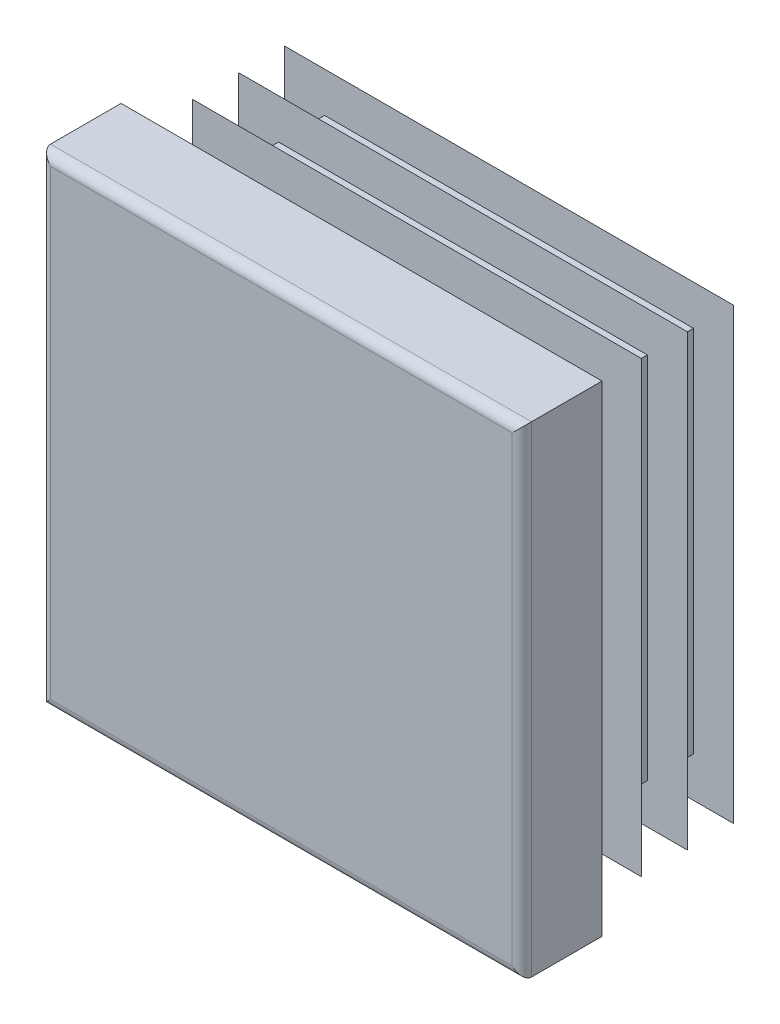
ISO-10303-21;
HEADER;
FILE_DESCRIPTION(('STEP AP214'),'2;1');
FILE_NAME('part.step','',(''),(''),'','','');
FILE_SCHEMA(('AUTOMOTIVE_DESIGN { 1 0 10303 214 1 1 1 1 }'));
ENDSEC;
DATA;
#1=APPLICATION_CONTEXT('core data for automotive mechanical design processes');
#2=APPLICATION_PROTOCOL_DEFINITION('international standard','automotive_design',2000,#1);
#3=PRODUCT_CONTEXT('',#1,'mechanical');
#4=PRODUCT('Part','Part','',(#3));
#5=PRODUCT_RELATED_PRODUCT_CATEGORY('part','',(#4));
#6=PRODUCT_DEFINITION_FORMATION('','',#4);
#7=PRODUCT_DEFINITION_CONTEXT('part definition',#1,'design');
#8=PRODUCT_DEFINITION('design','',#6,#7);
#9=PRODUCT_DEFINITION_SHAPE('','',#8);
#10=(LENGTH_UNIT() NAMED_UNIT(*) SI_UNIT(.MILLI.,.METRE.));
#11=(NAMED_UNIT(*) PLANE_ANGLE_UNIT() SI_UNIT($,.RADIAN.));
#12=(NAMED_UNIT(*) SI_UNIT($,.STERADIAN.) SOLID_ANGLE_UNIT());
#13=UNCERTAINTY_MEASURE_WITH_UNIT(LENGTH_MEASURE(1.E-05),#10,'distance_accuracy_value','');
#14=(GEOMETRIC_REPRESENTATION_CONTEXT(3) GLOBAL_UNCERTAINTY_ASSIGNED_CONTEXT((#13)) GLOBAL_UNIT_ASSIGNED_CONTEXT((#10,
#11,#12)) REPRESENTATION_CONTEXT('',''));
#15=CARTESIAN_POINT('',(0.,0.,0.));
#16=DIRECTION('',(0.,0.,1.));
#17=DIRECTION('',(1.,0.,0.));
#18=AXIS2_PLACEMENT_3D('',#15,#16,#17);
#19=CARTESIAN_POINT('',(14.4,-15.,5.));
#20=DIRECTION('',(0.,0.,-1.));
#21=DIRECTION('',(0.,1.,0.));
#22=AXIS2_PLACEMENT_3D('',#19,#20,#21);
#23=PLANE('',#22);
#24=DIRECTION('',(0.,1.,0.));
#25=VECTOR('',#24,1.);
#26=CARTESIAN_POINT('',(-14.4,-15.,5.));
#27=LINE('',#26,#25);
#28=CARTESIAN_POINT('',(-14.4,-14.4,5.));
#29=VERTEX_POINT('',#28);
#30=CARTESIAN_POINT('',(-14.4,14.4,5.));
#31=VERTEX_POINT('',#30);
#32=EDGE_CURVE('E262',#29,#31,#27,.T.);
#33=ORIENTED_EDGE('',*,*,#32,.F.);
#34=DIRECTION('',(-1.,0.,0.));
#35=VECTOR('',#34,1.);
#36=CARTESIAN_POINT('',(15.,-14.4,5.));
#37=LINE('',#36,#35);
#38=CARTESIAN_POINT('',(14.4,-14.4,5.));
#39=VERTEX_POINT('',#38);
#40=EDGE_CURVE('E432',#39,#29,#37,.T.);
#41=ORIENTED_EDGE('',*,*,#40,.F.);
#42=DIRECTION('',(0.,1.,0.));
#43=VECTOR('',#42,1.);
#44=CARTESIAN_POINT('',(14.4,-15.,5.));
#45=LINE('',#44,#43);
#46=CARTESIAN_POINT('',(14.4,14.4,5.));
#47=VERTEX_POINT('',#46);
#48=EDGE_CURVE('E257',#39,#47,#45,.T.);
#49=ORIENTED_EDGE('',*,*,#48,.T.);
#50=DIRECTION('',(-1.,0.,0.));
#51=VECTOR('',#50,1.);
#52=CARTESIAN_POINT('',(15.,14.4,5.));
#53=LINE('',#52,#51);
#54=EDGE_CURVE('E534',#47,#31,#53,.T.);
#55=ORIENTED_EDGE('',*,*,#54,.T.);
#56=EDGE_LOOP('',(#33,#41,#49,#55));
#57=FACE_BOUND('',#56,.T.);
#58=ADVANCED_FACE('F14',(#57),#23,.F.);
#59=CARTESIAN_POINT('',(-14.4,-15.,4.4));
#60=DIRECTION('',(0.,1.,0.));
#61=DIRECTION('',(-1.,0.,0.));
#62=AXIS2_PLACEMENT_3D('',#59,#60,#61);
#63=CYLINDRICAL_SURFACE('',#62,0.6);
#64=DIRECTION('',(0.,1.,0.));
#65=VECTOR('',#64,1.);
#66=CARTESIAN_POINT('',(-15.,-15.,4.4));
#67=LINE('',#66,#65);
#68=CARTESIAN_POINT('',(-15.,-15.,4.4));
#69=VERTEX_POINT('',#68);
#70=CARTESIAN_POINT('',(-15.,15.,4.4));
#71=VERTEX_POINT('',#70);
#72=EDGE_CURVE('E354',#69,#71,#67,.T.);
#73=ORIENTED_EDGE('',*,*,#72,.F.);
#74=CARTESIAN_POINT('',(-14.4,-14.4,4.4));
#75=DIRECTION('',(-0.707106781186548,0.707106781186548,0.));
#76=DIRECTION('',(0.707106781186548,0.707106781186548,0.));
#77=AXIS2_PLACEMENT_3D('',#74,#75,#76);
#78=ELLIPSE('',#77,0.848528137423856,0.6);
#79=EDGE_CURVE('E59',#69,#29,#78,.T.);
#80=ORIENTED_EDGE('',*,*,#79,.T.);
#81=ORIENTED_EDGE('',*,*,#32,.T.);
#82=CARTESIAN_POINT('',(-14.4,14.4,4.4));
#83=DIRECTION('',(0.707106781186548,0.707106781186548,0.));
#84=DIRECTION('',(-0.707106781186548,0.707106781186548,0.));
#85=AXIS2_PLACEMENT_3D('',#82,#83,#84);
#86=ELLIPSE('',#85,0.848528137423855,0.6);
#87=EDGE_CURVE('E258',#31,#71,#86,.F.);
#88=ORIENTED_EDGE('',*,*,#87,.T.);
#89=EDGE_LOOP('',(#73,#80,#81,#88));
#90=FACE_BOUND('',#89,.T.);
#91=ADVANCED_FACE('F16',(#90),#63,.T.);
#92=CARTESIAN_POINT('',(-15.,-15.,4.4));
#93=DIRECTION('',(1.,0.,0.));
#94=DIRECTION('',(0.,1.,0.));
#95=AXIS2_PLACEMENT_3D('',#92,#93,#94);
#96=PLANE('',#95);
#97=DIRECTION('',(0.,0.,-1.));
#98=VECTOR('',#97,1.);
#99=CARTESIAN_POINT('',(-15.,15.,4.4));
#100=LINE('',#99,#98);
#101=CARTESIAN_POINT('',(-15.,15.,0.));
#102=VERTEX_POINT('',#101);
#103=EDGE_CURVE('E519',#71,#102,#100,.T.);
#104=ORIENTED_EDGE('',*,*,#103,.T.);
#105=DIRECTION('',(0.,1.,0.));
#106=VECTOR('',#105,1.);
#107=CARTESIAN_POINT('',(-15.,-15.,0.));
#108=LINE('',#107,#106);
#109=CARTESIAN_POINT('',(-15.,-15.,0.));
#110=VERTEX_POINT('',#109);
#111=EDGE_CURVE('E352',#110,#102,#108,.T.);
#112=ORIENTED_EDGE('',*,*,#111,.F.);
#113=DIRECTION('',(0.,0.,-1.));
#114=VECTOR('',#113,1.);
#115=CARTESIAN_POINT('',(-15.,-15.,4.4));
#116=LINE('',#115,#114);
#117=EDGE_CURVE('E520',#69,#110,#116,.T.);
#118=ORIENTED_EDGE('',*,*,#117,.F.);
#119=ORIENTED_EDGE('',*,*,#72,.T.);
#120=EDGE_LOOP('',(#104,#112,#118,#119));
#121=FACE_BOUND('',#120,.T.);
#122=ADVANCED_FACE('F604',(#121),#96,.F.);
#123=CARTESIAN_POINT('',(-11.5,-15.,0.));
#124=DIRECTION('',(1.,0.,0.));
#125=DIRECTION('',(0.,1.,0.));
#126=AXIS2_PLACEMENT_3D('',#123,#124,#125);
#127=PLANE('',#126);
#128=DIRECTION('',(0.,1.,0.));
#129=VECTOR('',#128,1.);
#130=CARTESIAN_POINT('',(-11.5,-15.,0.));
#131=LINE('',#130,#129);
#132=CARTESIAN_POINT('',(-11.5,-11.5,0.));
#133=VERTEX_POINT('',#132);
#134=CARTESIAN_POINT('',(-11.5,11.5,0.));
#135=VERTEX_POINT('',#134);
#136=EDGE_CURVE('E349',#133,#135,#131,.T.);
#137=ORIENTED_EDGE('',*,*,#136,.T.);
#138=DIRECTION('',(0.,0.,-1.));
#139=VECTOR('',#138,1.);
#140=CARTESIAN_POINT('',(-11.5,11.5,0.));
#141=LINE('',#140,#139);
#142=CARTESIAN_POINT('',(-11.5,11.5,-0.575));
#143=VERTEX_POINT('',#142);
#144=EDGE_CURVE('E445',#135,#143,#141,.T.);
#145=ORIENTED_EDGE('',*,*,#144,.T.);
#146=DIRECTION('',(0.,1.,0.));
#147=VECTOR('',#146,1.);
#148=CARTESIAN_POINT('',(-11.5,-15.,-0.575));
#149=LINE('',#148,#147);
#150=CARTESIAN_POINT('',(-11.5,-11.5,-0.575));
#151=VERTEX_POINT('',#150);
#152=EDGE_CURVE('E346',#151,#143,#149,.T.);
#153=ORIENTED_EDGE('',*,*,#152,.F.);
#154=DIRECTION('',(0.,0.,1.));
#155=VECTOR('',#154,1.);
#156=CARTESIAN_POINT('',(-11.5,-11.5,0.));
#157=LINE('',#156,#155);
#158=EDGE_CURVE('E439',#151,#133,#157,.T.);
#159=ORIENTED_EDGE('',*,*,#158,.T.);
#160=EDGE_LOOP('',(#137,#145,#153,#159));
#161=FACE_BOUND('',#160,.T.);
#162=ADVANCED_FACE('F728',(#161),#127,.F.);
#163=CARTESIAN_POINT('',(-14.,-15.,-0.575));
#164=DIRECTION('',(0.573576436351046,0.,0.819152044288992));
#165=DIRECTION('',(-0.819152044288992,0.,0.573576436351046));
#166=AXIS2_PLACEMENT_3D('',#163,#164,#165);
#167=PLANE('',#166);
#168=DIRECTION('',(0.,1.,0.));
#169=VECTOR('',#168,1.);
#170=CARTESIAN_POINT('',(-14.,-15.,-0.575));
#171=LINE('',#170,#169);
#172=CARTESIAN_POINT('',(-14.,-14.,-0.575));
#173=VERTEX_POINT('',#172);
#174=CARTESIAN_POINT('',(-14.,14.,-0.575));
#175=VERTEX_POINT('',#174);
#176=EDGE_CURVE('E344',#173,#175,#171,.T.);
#177=ORIENTED_EDGE('',*,*,#176,.T.);
#178=DIRECTION('',(0.633687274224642,-0.633687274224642,-0.443712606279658));
#179=VECTOR('',#178,1.);
#180=CARTESIAN_POINT('',(-2.35477271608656,2.35477271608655,-8.72907592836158));
#181=LINE('',#180,#179);
#182=CARTESIAN_POINT('',(-11.5,11.5,-2.32551884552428));
#183=VERTEX_POINT('',#182);
#184=EDGE_CURVE('E457',#175,#183,#181,.T.);
#185=ORIENTED_EDGE('',*,*,#184,.T.);
#186=DIRECTION('',(0.,1.,0.));
#187=VECTOR('',#186,1.);
#188=CARTESIAN_POINT('',(-11.5,-15.,-2.32551884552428));
#189=LINE('',#188,#187);
#190=CARTESIAN_POINT('',(-11.5,-11.5,-2.32551884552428));
#191=VERTEX_POINT('',#190);
#192=EDGE_CURVE('E341',#191,#183,#189,.T.);
#193=ORIENTED_EDGE('',*,*,#192,.F.);
#194=DIRECTION('',(-0.633687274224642,-0.633687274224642,0.443712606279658));
#195=VECTOR('',#194,1.);
#196=CARTESIAN_POINT('',(-14.4015595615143,-14.4015595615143,-0.293824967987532));
#197=LINE('',#196,#195);
#198=EDGE_CURVE('E451',#191,#173,#197,.T.);
#199=ORIENTED_EDGE('',*,*,#198,.T.);
#200=EDGE_LOOP('',(#177,#185,#193,#199));
#201=FACE_BOUND('',#200,.T.);
#202=ADVANCED_FACE('F732',(#201),#167,.F.);
#203=CARTESIAN_POINT('',(-11.5,-15.,-2.32551884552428));
#204=DIRECTION('',(1.,0.,0.));
#205=DIRECTION('',(0.,1.,0.));
#206=AXIS2_PLACEMENT_3D('',#203,#204,#205);
#207=PLANE('',#206);
#208=ORIENTED_EDGE('',*,*,#192,.T.);
#209=DIRECTION('',(0.,0.,-1.));
#210=VECTOR('',#209,1.);
#211=CARTESIAN_POINT('',(-11.5,11.5,-2.32551884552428));
#212=LINE('',#211,#210);
#213=CARTESIAN_POINT('',(-11.5,11.5,-3.45));
#214=VERTEX_POINT('',#213);
#215=EDGE_CURVE('E463',#183,#214,#212,.T.);
#216=ORIENTED_EDGE('',*,*,#215,.T.);
#217=DIRECTION('',(0.,1.,0.));
#218=VECTOR('',#217,1.);
#219=CARTESIAN_POINT('',(-11.5,-15.,-3.45));
#220=LINE('',#219,#218);
#221=CARTESIAN_POINT('',(-11.5,-11.5,-3.45));
#222=VERTEX_POINT('',#221);
#223=EDGE_CURVE('E338',#222,#214,#220,.T.);
#224=ORIENTED_EDGE('',*,*,#223,.F.);
#225=DIRECTION('',(0.,0.,1.));
#226=VECTOR('',#225,1.);
#227=CARTESIAN_POINT('',(-11.5,-11.5,-2.32551884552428));
#228=LINE('',#227,#226);
#229=EDGE_CURVE('E460',#222,#191,#228,.T.);
#230=ORIENTED_EDGE('',*,*,#229,.T.);
#231=EDGE_LOOP('',(#208,#216,#224,#230));
#232=FACE_BOUND('',#231,.T.);
#233=ADVANCED_FACE('F738',(#232),#207,.F.);
#234=CARTESIAN_POINT('',(-14.,-15.,-3.45));
#235=DIRECTION('',(0.573576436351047,0.,0.819152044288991));
#236=DIRECTION('',(-0.819152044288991,0.,0.573576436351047));
#237=AXIS2_PLACEMENT_3D('',#234,#235,#236);
#238=PLANE('',#237);
#239=DIRECTION('',(0.,1.,0.));
#240=VECTOR('',#239,1.);
#241=CARTESIAN_POINT('',(-14.,-15.,-3.45));
#242=LINE('',#241,#240);
#243=CARTESIAN_POINT('',(-14.,-14.,-3.45));
#244=VERTEX_POINT('',#243);
#245=CARTESIAN_POINT('',(-14.,14.,-3.45));
#246=VERTEX_POINT('',#245);
#247=EDGE_CURVE('E336',#244,#246,#242,.T.);
#248=ORIENTED_EDGE('',*,*,#247,.T.);
#249=DIRECTION('',(0.633687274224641,-0.633687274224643,-0.443712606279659));
#250=VECTOR('',#249,1.);
#251=CARTESIAN_POINT('',(-2.35477271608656,2.35477271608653,-11.6040759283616));
#252=LINE('',#251,#250);
#253=CARTESIAN_POINT('',(-11.5,11.5,-5.20051884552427));
#254=VERTEX_POINT('',#253);
#255=EDGE_CURVE('E475',#246,#254,#252,.T.);
#256=ORIENTED_EDGE('',*,*,#255,.T.);
#257=DIRECTION('',(0.,1.,0.));
#258=VECTOR('',#257,1.);
#259=CARTESIAN_POINT('',(-11.5,-15.,-5.20051884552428));
#260=LINE('',#259,#258);
#261=CARTESIAN_POINT('',(-11.5,-11.5,-5.20051884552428));
#262=VERTEX_POINT('',#261);
#263=EDGE_CURVE('E333',#262,#254,#260,.T.);
#264=ORIENTED_EDGE('',*,*,#263,.F.);
#265=DIRECTION('',(-0.633687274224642,-0.633687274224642,0.443712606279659));
#266=VECTOR('',#265,1.);
#267=CARTESIAN_POINT('',(-14.4015595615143,-14.4015595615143,-3.16882496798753));
#268=LINE('',#267,#266);
#269=EDGE_CURVE('E469',#262,#244,#268,.T.);
#270=ORIENTED_EDGE('',*,*,#269,.T.);
#271=EDGE_LOOP('',(#248,#256,#264,#270));
#272=FACE_BOUND('',#271,.T.);
#273=ADVANCED_FACE('F742',(#272),#238,.F.);
#274=CARTESIAN_POINT('',(-11.5,-15.,-5.20051884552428));
#275=DIRECTION('',(1.,0.,0.));
#276=DIRECTION('',(0.,1.,0.));
#277=AXIS2_PLACEMENT_3D('',#274,#275,#276);
#278=PLANE('',#277);
#279=ORIENTED_EDGE('',*,*,#263,.T.);
#280=DIRECTION('',(0.,0.,-1.));
#281=VECTOR('',#280,1.);
#282=CARTESIAN_POINT('',(-11.5,11.5,-5.20051884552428));
#283=LINE('',#282,#281);
#284=CARTESIAN_POINT('',(-11.5,11.5,-6.325));
#285=VERTEX_POINT('',#284);
#286=EDGE_CURVE('E481',#254,#285,#283,.T.);
#287=ORIENTED_EDGE('',*,*,#286,.T.);
#288=DIRECTION('',(0.,1.,0.));
#289=VECTOR('',#288,1.);
#290=CARTESIAN_POINT('',(-11.5,-15.,-6.325));
#291=LINE('',#290,#289);
#292=CARTESIAN_POINT('',(-11.5,-11.5,-6.325));
#293=VERTEX_POINT('',#292);
#294=EDGE_CURVE('E330',#293,#285,#291,.T.);
#295=ORIENTED_EDGE('',*,*,#294,.F.);
#296=DIRECTION('',(0.,0.,1.));
#297=VECTOR('',#296,1.);
#298=CARTESIAN_POINT('',(-11.5,-11.5,-5.20051884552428));
#299=LINE('',#298,#297);
#300=EDGE_CURVE('E478',#293,#262,#299,.T.);
#301=ORIENTED_EDGE('',*,*,#300,.T.);
#302=EDGE_LOOP('',(#279,#287,#295,#301));
#303=FACE_BOUND('',#302,.T.);
#304=ADVANCED_FACE('F746',(#303),#278,.F.);
#305=CARTESIAN_POINT('',(-14.,-15.,-6.325));
#306=DIRECTION('',(0.573576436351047,0.,0.819152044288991));
#307=DIRECTION('',(-0.819152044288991,0.,0.573576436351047));
#308=AXIS2_PLACEMENT_3D('',#305,#306,#307);
#309=PLANE('',#308);
#310=DIRECTION('',(0.,1.,0.));
#311=VECTOR('',#310,1.);
#312=CARTESIAN_POINT('',(-14.,-15.,-6.325));
#313=LINE('',#312,#311);
#314=CARTESIAN_POINT('',(-14.,-14.,-6.325));
#315=VERTEX_POINT('',#314);
#316=CARTESIAN_POINT('',(-14.,14.,-6.325));
#317=VERTEX_POINT('',#316);
#318=EDGE_CURVE('E328',#315,#317,#313,.T.);
#319=ORIENTED_EDGE('',*,*,#318,.T.);
#320=DIRECTION('',(0.633687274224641,-0.633687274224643,-0.443712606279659));
#321=VECTOR('',#320,1.);
#322=CARTESIAN_POINT('',(-2.35477271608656,2.35477271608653,-14.4790759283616));
#323=LINE('',#322,#321);
#324=CARTESIAN_POINT('',(-11.5,11.5,-8.07551884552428));
#325=VERTEX_POINT('',#324);
#326=EDGE_CURVE('E493',#317,#325,#323,.T.);
#327=ORIENTED_EDGE('',*,*,#326,.T.);
#328=DIRECTION('',(0.,1.,0.));
#329=VECTOR('',#328,1.);
#330=CARTESIAN_POINT('',(-11.5,-15.,-8.07551884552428));
#331=LINE('',#330,#329);
#332=CARTESIAN_POINT('',(-11.5,-11.5,-8.07551884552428));
#333=VERTEX_POINT('',#332);
#334=EDGE_CURVE('E325',#333,#325,#331,.T.);
#335=ORIENTED_EDGE('',*,*,#334,.F.);
#336=DIRECTION('',(-0.633687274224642,-0.633687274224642,0.443712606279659));
#337=VECTOR('',#336,1.);
#338=CARTESIAN_POINT('',(-14.4015595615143,-14.4015595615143,-6.04382496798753));
#339=LINE('',#338,#337);
#340=EDGE_CURVE('E487',#333,#315,#339,.T.);
#341=ORIENTED_EDGE('',*,*,#340,.T.);
#342=EDGE_LOOP('',(#319,#327,#335,#341));
#343=FACE_BOUND('',#342,.T.);
#344=ADVANCED_FACE('F668',(#343),#309,.F.);
#345=CARTESIAN_POINT('',(-11.5,-15.,-8.07551884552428));
#346=DIRECTION('',(1.,0.,0.));
#347=DIRECTION('',(0.,1.,0.));
#348=AXIS2_PLACEMENT_3D('',#345,#346,#347);
#349=PLANE('',#348);
#350=ORIENTED_EDGE('',*,*,#334,.T.);
#351=DIRECTION('',(0.,0.,-1.));
#352=VECTOR('',#351,1.);
#353=CARTESIAN_POINT('',(-11.5,11.5,-8.07551884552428));
#354=LINE('',#353,#352);
#355=CARTESIAN_POINT('',(-11.5,11.5,-9.2));
#356=VERTEX_POINT('',#355);
#357=EDGE_CURVE('E499',#325,#356,#354,.T.);
#358=ORIENTED_EDGE('',*,*,#357,.T.);
#359=DIRECTION('',(0.,1.,0.));
#360=VECTOR('',#359,1.);
#361=CARTESIAN_POINT('',(-11.5,-15.,-9.2));
#362=LINE('',#361,#360);
#363=CARTESIAN_POINT('',(-11.5,-11.5,-9.2));
#364=VERTEX_POINT('',#363);
#365=EDGE_CURVE('E322',#364,#356,#362,.T.);
#366=ORIENTED_EDGE('',*,*,#365,.F.);
#367=DIRECTION('',(0.,0.,1.));
#368=VECTOR('',#367,1.);
#369=CARTESIAN_POINT('',(-11.5,-11.5,-8.07551884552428));
#370=LINE('',#369,#368);
#371=EDGE_CURVE('E496',#364,#333,#370,.T.);
#372=ORIENTED_EDGE('',*,*,#371,.T.);
#373=EDGE_LOOP('',(#350,#358,#366,#372));
#374=FACE_BOUND('',#373,.T.);
#375=ADVANCED_FACE('F665',(#374),#349,.F.);
#376=CARTESIAN_POINT('',(-14.,-15.,-9.2));
#377=DIRECTION('',(0.573576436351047,0.,0.819152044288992));
#378=DIRECTION('',(-0.819152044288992,0.,0.573576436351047));
#379=AXIS2_PLACEMENT_3D('',#376,#377,#378);
#380=PLANE('',#379);
#381=DIRECTION('',(0.,1.,0.));
#382=VECTOR('',#381,1.);
#383=CARTESIAN_POINT('',(-14.,-15.,-9.2));
#384=LINE('',#383,#382);
#385=CARTESIAN_POINT('',(-14.,-14.,-9.2));
#386=VERTEX_POINT('',#385);
#387=CARTESIAN_POINT('',(-14.,14.,-9.2));
#388=VERTEX_POINT('',#387);
#389=EDGE_CURVE('E320',#386,#388,#384,.T.);
#390=ORIENTED_EDGE('',*,*,#389,.T.);
#391=DIRECTION('',(0.633687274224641,-0.633687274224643,-0.443712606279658));
#392=VECTOR('',#391,1.);
#393=CARTESIAN_POINT('',(-2.35477271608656,2.35477271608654,-17.3540759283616));
#394=LINE('',#393,#392);
#395=CARTESIAN_POINT('',(-11.5,11.5,-10.9505188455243));
#396=VERTEX_POINT('',#395);
#397=EDGE_CURVE('E511',#388,#396,#394,.T.);
#398=ORIENTED_EDGE('',*,*,#397,.T.);
#399=DIRECTION('',(0.,1.,0.));
#400=VECTOR('',#399,1.);
#401=CARTESIAN_POINT('',(-11.5,-15.,-10.9505188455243));
#402=LINE('',#401,#400);
#403=CARTESIAN_POINT('',(-11.5,-11.5,-10.9505188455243));
#404=VERTEX_POINT('',#403);
#405=EDGE_CURVE('E317',#404,#396,#402,.T.);
#406=ORIENTED_EDGE('',*,*,#405,.F.);
#407=DIRECTION('',(-0.633687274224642,-0.633687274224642,0.443712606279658));
#408=VECTOR('',#407,1.);
#409=CARTESIAN_POINT('',(-14.4015595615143,-14.4015595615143,-8.91882496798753));
#410=LINE('',#409,#408);
#411=EDGE_CURVE('E505',#404,#386,#410,.T.);
#412=ORIENTED_EDGE('',*,*,#411,.T.);
#413=EDGE_LOOP('',(#390,#398,#406,#412));
#414=FACE_BOUND('',#413,.T.);
#415=ADVANCED_FACE('F580',(#414),#380,.F.);
#416=CARTESIAN_POINT('',(-11.5,-15.,-10.9505188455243));
#417=DIRECTION('',(1.,0.,0.));
#418=DIRECTION('',(0.,1.,0.));
#419=AXIS2_PLACEMENT_3D('',#416,#417,#418);
#420=PLANE('',#419);
#421=ORIENTED_EDGE('',*,*,#405,.T.);
#422=DIRECTION('',(0.,0.,-1.));
#423=VECTOR('',#422,1.);
#424=CARTESIAN_POINT('',(-11.5,11.5,-10.9505188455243));
#425=LINE('',#424,#423);
#426=CARTESIAN_POINT('',(-11.5,11.5,-11.5));
#427=VERTEX_POINT('',#426);
#428=EDGE_CURVE('E517',#396,#427,#425,.T.);
#429=ORIENTED_EDGE('',*,*,#428,.T.);
#430=DIRECTION('',(0.,1.,0.));
#431=VECTOR('',#430,1.);
#432=CARTESIAN_POINT('',(-11.5,-15.,-11.5));
#433=LINE('',#432,#431);
#434=CARTESIAN_POINT('',(-11.5,-11.5,-11.5));
#435=VERTEX_POINT('',#434);
#436=EDGE_CURVE('E314',#435,#427,#433,.T.);
#437=ORIENTED_EDGE('',*,*,#436,.F.);
#438=DIRECTION('',(0.,0.,1.));
#439=VECTOR('',#438,1.);
#440=CARTESIAN_POINT('',(-11.5,-11.5,-10.9505188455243));
#441=LINE('',#440,#439);
#442=EDGE_CURVE('E514',#435,#404,#441,.T.);
#443=ORIENTED_EDGE('',*,*,#442,.T.);
#444=EDGE_LOOP('',(#421,#429,#437,#443));
#445=FACE_BOUND('',#444,.T.);
#446=ADVANCED_FACE('F582',(#445),#420,.F.);
#447=CARTESIAN_POINT('',(-11.5,-15.,-11.5));
#448=DIRECTION('',(0.,0.,1.));
#449=DIRECTION('',(0.,-1.,0.));
#450=AXIS2_PLACEMENT_3D('',#447,#448,#449);
#451=PLANE('',#450);
#452=ORIENTED_EDGE('',*,*,#436,.T.);
#453=DIRECTION('',(-1.,0.,0.));
#454=VECTOR('',#453,1.);
#455=CARTESIAN_POINT('',(15.,11.5,-11.5));
#456=LINE('',#455,#454);
#457=CARTESIAN_POINT('',(11.5,11.5,-11.5));
#458=VERTEX_POINT('',#457);
#459=EDGE_CURVE('E388',#458,#427,#456,.T.);
#460=ORIENTED_EDGE('',*,*,#459,.F.);
#461=DIRECTION('',(0.,1.,0.));
#462=VECTOR('',#461,1.);
#463=CARTESIAN_POINT('',(11.5,-15.,-11.5));
#464=LINE('',#463,#462);
#465=CARTESIAN_POINT('',(11.5,-11.5,-11.5));
#466=VERTEX_POINT('',#465);
#467=EDGE_CURVE('E311',#466,#458,#464,.T.);
#468=ORIENTED_EDGE('',*,*,#467,.F.);
#469=DIRECTION('',(-1.,0.,0.));
#470=VECTOR('',#469,1.);
#471=CARTESIAN_POINT('',(15.,-11.5,-11.5));
#472=LINE('',#471,#470);
#473=EDGE_CURVE('E386',#466,#435,#472,.T.);
#474=ORIENTED_EDGE('',*,*,#473,.T.);
#475=EDGE_LOOP('',(#452,#460,#468,#474));
#476=FACE_BOUND('',#475,.T.);
#477=ADVANCED_FACE('F385',(#476),#451,.F.);
#478=CARTESIAN_POINT('',(11.5,-15.,-11.5));
#479=DIRECTION('',(-1.,0.,0.));
#480=DIRECTION('',(0.,-1.,0.));
#481=AXIS2_PLACEMENT_3D('',#478,#479,#480);
#482=PLANE('',#481);
#483=ORIENTED_EDGE('',*,*,#467,.T.);
#484=DIRECTION('',(0.,0.,1.));
#485=VECTOR('',#484,1.);
#486=CARTESIAN_POINT('',(11.5,11.5,-11.5));
#487=LINE('',#486,#485);
#488=CARTESIAN_POINT('',(11.5,11.5,-10.9505188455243));
#489=VERTEX_POINT('',#488);
#490=EDGE_CURVE('E9',#458,#489,#487,.T.);
#491=ORIENTED_EDGE('',*,*,#490,.T.);
#492=DIRECTION('',(0.,1.,0.));
#493=VECTOR('',#492,1.);
#494=CARTESIAN_POINT('',(11.5,-15.,-10.9505188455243));
#495=LINE('',#494,#493);
#496=CARTESIAN_POINT('',(11.5,-11.5,-10.9505188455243));
#497=VERTEX_POINT('',#496);
#498=EDGE_CURVE('E308',#497,#489,#495,.T.);
#499=ORIENTED_EDGE('',*,*,#498,.F.);
#500=DIRECTION('',(0.,0.,-1.));
#501=VECTOR('',#500,1.);
#502=CARTESIAN_POINT('',(11.5,-11.5,-11.5));
#503=LINE('',#502,#501);
#504=EDGE_CURVE('E23',#497,#466,#503,.T.);
#505=ORIENTED_EDGE('',*,*,#504,.T.);
#506=EDGE_LOOP('',(#483,#491,#499,#505));
#507=FACE_BOUND('',#506,.T.);
#508=ADVANCED_FACE('F378',(#507),#482,.F.);
#509=CARTESIAN_POINT('',(11.5,-15.,-10.9505188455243));
#510=DIRECTION('',(-0.573576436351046,0.,0.819152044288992));
#511=DIRECTION('',(-0.819152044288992,0.,-0.573576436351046));
#512=AXIS2_PLACEMENT_3D('',#509,#510,#511);
#513=PLANE('',#512);
#514=ORIENTED_EDGE('',*,*,#498,.T.);
#515=DIRECTION('',(0.633687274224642,0.633687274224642,0.443712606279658));
#516=VECTOR('',#515,1.);
#517=CARTESIAN_POINT('',(0.858671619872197,0.858671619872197,-18.4016571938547));
#518=LINE('',#517,#516);
#519=CARTESIAN_POINT('',(14.,14.,-9.2));
#520=VERTEX_POINT('',#519);
#521=EDGE_CURVE('E508',#489,#520,#518,.T.);
#522=ORIENTED_EDGE('',*,*,#521,.T.);
#523=DIRECTION('',(0.,1.,0.));
#524=VECTOR('',#523,1.);
#525=CARTESIAN_POINT('',(14.,-15.,-9.2));
#526=LINE('',#525,#524);
#527=CARTESIAN_POINT('',(14.,-14.,-9.2));
#528=VERTEX_POINT('',#527);
#529=EDGE_CURVE('E305',#528,#520,#526,.T.);
#530=ORIENTED_EDGE('',*,*,#529,.F.);
#531=DIRECTION('',(-0.633687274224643,0.633687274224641,-0.443712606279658));
#532=VECTOR('',#531,1.);
#533=CARTESIAN_POINT('',(12.9054584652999,-12.9054584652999,-9.96640623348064));
#534=LINE('',#533,#532);
#535=EDGE_CURVE('E502',#528,#497,#534,.T.);
#536=ORIENTED_EDGE('',*,*,#535,.T.);
#537=EDGE_LOOP('',(#514,#522,#530,#536));
#538=FACE_BOUND('',#537,.T.);
#539=ADVANCED_FACE('F588',(#538),#513,.F.);
#540=CARTESIAN_POINT('',(14.,-15.,-9.2));
#541=DIRECTION('',(0.,0.,-1.));
#542=DIRECTION('',(0.,1.,0.));
#543=AXIS2_PLACEMENT_3D('',#540,#541,#542);
#544=PLANE('',#543);
#545=ORIENTED_EDGE('',*,*,#529,.T.);
#546=DIRECTION('',(-1.,0.,0.));
#547=VECTOR('',#546,1.);
#548=CARTESIAN_POINT('',(15.,14.,-9.2));
#549=LINE('',#548,#547);
#550=EDGE_CURVE('E394',#520,#388,#549,.T.);
#551=ORIENTED_EDGE('',*,*,#550,.T.);
#552=ORIENTED_EDGE('',*,*,#389,.F.);
#553=DIRECTION('',(-1.,0.,0.));
#554=VECTOR('',#553,1.);
#555=CARTESIAN_POINT('',(15.,-14.,-9.2));
#556=LINE('',#555,#554);
#557=EDGE_CURVE('E401',#528,#386,#556,.T.);
#558=ORIENTED_EDGE('',*,*,#557,.F.);
#559=EDGE_LOOP('',(#545,#551,#552,#558));
#560=FACE_BOUND('',#559,.T.);
#561=ORIENTED_EDGE('',*,*,#365,.T.);
#562=DIRECTION('',(-1.,0.,0.));
#563=VECTOR('',#562,1.);
#564=CARTESIAN_POINT('',(15.,11.5,-9.2));
#565=LINE('',#564,#563);
#566=CARTESIAN_POINT('',(11.5,11.5,-9.2));
#567=VERTEX_POINT('',#566);
#568=EDGE_CURVE('E567',#567,#356,#565,.T.);
#569=ORIENTED_EDGE('',*,*,#568,.F.);
#570=DIRECTION('',(0.,1.,0.));
#571=VECTOR('',#570,1.);
#572=CARTESIAN_POINT('',(11.5,-15.,-9.2));
#573=LINE('',#572,#571);
#574=CARTESIAN_POINT('',(11.5,-11.5,-9.2));
#575=VERTEX_POINT('',#574);
#576=EDGE_CURVE('E302',#575,#567,#573,.T.);
#577=ORIENTED_EDGE('',*,*,#576,.F.);
#578=DIRECTION('',(-1.,0.,0.));
#579=VECTOR('',#578,1.);
#580=CARTESIAN_POINT('',(15.,-11.5,-9.2));
#581=LINE('',#580,#579);
#582=EDGE_CURVE('E403',#575,#364,#581,.T.);
#583=ORIENTED_EDGE('',*,*,#582,.T.);
#584=EDGE_LOOP('',(#561,#569,#577,#583));
#585=FACE_BOUND('',#584,.T.);
#586=ADVANCED_FACE('F571',(#560,#585),#544,.F.);
#587=CARTESIAN_POINT('',(11.5,-15.,-9.2));
#588=DIRECTION('',(-1.,0.,0.));
#589=DIRECTION('',(0.,-1.,0.));
#590=AXIS2_PLACEMENT_3D('',#587,#588,#589);
#591=PLANE('',#590);
#592=ORIENTED_EDGE('',*,*,#576,.T.);
#593=DIRECTION('',(0.,0.,1.));
#594=VECTOR('',#593,1.);
#595=CARTESIAN_POINT('',(11.5,11.5,-9.2));
#596=LINE('',#595,#594);
#597=CARTESIAN_POINT('',(11.5,11.5,-8.07551884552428));
#598=VERTEX_POINT('',#597);
#599=EDGE_CURVE('E372',#567,#598,#596,.T.);
#600=ORIENTED_EDGE('',*,*,#599,.T.);
#601=DIRECTION('',(0.,1.,0.));
#602=VECTOR('',#601,1.);
#603=CARTESIAN_POINT('',(11.5,-15.,-8.07551884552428));
#604=LINE('',#603,#602);
#605=CARTESIAN_POINT('',(11.5,-11.5,-8.07551884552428));
#606=VERTEX_POINT('',#605);
#607=EDGE_CURVE('E299',#606,#598,#604,.T.);
#608=ORIENTED_EDGE('',*,*,#607,.F.);
#609=DIRECTION('',(0.,0.,-1.));
#610=VECTOR('',#609,1.);
#611=CARTESIAN_POINT('',(11.5,-11.5,-9.2));
#612=LINE('',#611,#610);
#613=EDGE_CURVE('E369',#606,#575,#612,.T.);
#614=ORIENTED_EDGE('',*,*,#613,.T.);
#615=EDGE_LOOP('',(#592,#600,#608,#614));
#616=FACE_BOUND('',#615,.T.);
#617=ADVANCED_FACE('F596',(#616),#591,.F.);
#618=CARTESIAN_POINT('',(11.5,-15.,-8.07551884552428));
#619=DIRECTION('',(-0.573576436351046,0.,0.819152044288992));
#620=DIRECTION('',(-0.819152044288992,0.,-0.573576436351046));
#621=AXIS2_PLACEMENT_3D('',#618,#619,#620);
#622=PLANE('',#621);
#623=ORIENTED_EDGE('',*,*,#607,.T.);
#624=DIRECTION('',(0.633687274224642,0.633687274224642,0.443712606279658));
#625=VECTOR('',#624,1.);
#626=CARTESIAN_POINT('',(0.858671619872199,0.858671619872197,-15.5266571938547));
#627=LINE('',#626,#625);
#628=CARTESIAN_POINT('',(14.,14.,-6.325));
#629=VERTEX_POINT('',#628);
#630=EDGE_CURVE('E490',#598,#629,#627,.T.);
#631=ORIENTED_EDGE('',*,*,#630,.T.);
#632=DIRECTION('',(0.,1.,0.));
#633=VECTOR('',#632,1.);
#634=CARTESIAN_POINT('',(14.,-15.,-6.325));
#635=LINE('',#634,#633);
#636=CARTESIAN_POINT('',(14.,-14.,-6.325));
#637=VERTEX_POINT('',#636);
#638=EDGE_CURVE('E296',#637,#629,#635,.T.);
#639=ORIENTED_EDGE('',*,*,#638,.F.);
#640=DIRECTION('',(-0.633687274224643,0.633687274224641,-0.443712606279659));
#641=VECTOR('',#640,1.);
#642=CARTESIAN_POINT('',(12.9054584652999,-12.9054584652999,-7.09140623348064));
#643=LINE('',#642,#641);
#644=EDGE_CURVE('E484',#637,#606,#643,.T.);
#645=ORIENTED_EDGE('',*,*,#644,.T.);
#646=EDGE_LOOP('',(#623,#631,#639,#645));
#647=FACE_BOUND('',#646,.T.);
#648=ADVANCED_FACE('F648',(#647),#622,.F.);
#649=CARTESIAN_POINT('',(14.,-15.,-6.325));
#650=DIRECTION('',(0.,0.,-1.));
#651=DIRECTION('',(0.,1.,0.));
#652=AXIS2_PLACEMENT_3D('',#649,#650,#651);
#653=PLANE('',#652);
#654=ORIENTED_EDGE('',*,*,#638,.T.);
#655=DIRECTION('',(-1.,0.,0.));
#656=VECTOR('',#655,1.);
#657=CARTESIAN_POINT('',(15.,14.,-6.325));
#658=LINE('',#657,#656);
#659=EDGE_CURVE('E561',#629,#317,#658,.T.);
#660=ORIENTED_EDGE('',*,*,#659,.T.);
#661=ORIENTED_EDGE('',*,*,#318,.F.);
#662=DIRECTION('',(-1.,0.,0.));
#663=VECTOR('',#662,1.);
#664=CARTESIAN_POINT('',(15.,-14.,-6.325));
#665=LINE('',#664,#663);
#666=EDGE_CURVE('E409',#637,#315,#665,.T.);
#667=ORIENTED_EDGE('',*,*,#666,.F.);
#668=EDGE_LOOP('',(#654,#660,#661,#667));
#669=FACE_BOUND('',#668,.T.);
#670=ORIENTED_EDGE('',*,*,#294,.T.);
#671=DIRECTION('',(-1.,0.,0.));
#672=VECTOR('',#671,1.);
#673=CARTESIAN_POINT('',(15.,11.5,-6.325));
#674=LINE('',#673,#672);
#675=CARTESIAN_POINT('',(11.5,11.5,-6.325));
#676=VERTEX_POINT('',#675);
#677=EDGE_CURVE('E559',#676,#285,#674,.T.);
#678=ORIENTED_EDGE('',*,*,#677,.F.);
#679=DIRECTION('',(0.,1.,0.));
#680=VECTOR('',#679,1.);
#681=CARTESIAN_POINT('',(11.5,-15.,-6.325));
#682=LINE('',#681,#680);
#683=CARTESIAN_POINT('',(11.5,-11.5,-6.325));
#684=VERTEX_POINT('',#683);
#685=EDGE_CURVE('E293',#684,#676,#682,.T.);
#686=ORIENTED_EDGE('',*,*,#685,.F.);
#687=DIRECTION('',(-1.,0.,0.));
#688=VECTOR('',#687,1.);
#689=CARTESIAN_POINT('',(15.,-11.5,-6.325));
#690=LINE('',#689,#688);
#691=EDGE_CURVE('E411',#684,#293,#690,.T.);
#692=ORIENTED_EDGE('',*,*,#691,.T.);
#693=EDGE_LOOP('',(#670,#678,#686,#692));
#694=FACE_BOUND('',#693,.T.);
#695=ADVANCED_FACE('F644',(#669,#694),#653,.F.);
#696=CARTESIAN_POINT('',(11.5,-15.,-6.325));
#697=DIRECTION('',(-1.,0.,0.));
#698=DIRECTION('',(0.,-1.,0.));
#699=AXIS2_PLACEMENT_3D('',#696,#697,#698);
#700=PLANE('',#699);
#701=ORIENTED_EDGE('',*,*,#685,.T.);
#702=DIRECTION('',(0.,0.,1.));
#703=VECTOR('',#702,1.);
#704=CARTESIAN_POINT('',(11.5,11.5,-6.325));
#705=LINE('',#704,#703);
#706=CARTESIAN_POINT('',(11.5,11.5,-5.20051884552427));
#707=VERTEX_POINT('',#706);
#708=EDGE_CURVE('E366',#676,#707,#705,.T.);
#709=ORIENTED_EDGE('',*,*,#708,.T.);
#710=DIRECTION('',(0.,1.,0.));
#711=VECTOR('',#710,1.);
#712=CARTESIAN_POINT('',(11.5,-15.,-5.20051884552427));
#713=LINE('',#712,#711);
#714=CARTESIAN_POINT('',(11.5,-11.5,-5.20051884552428));
#715=VERTEX_POINT('',#714);
#716=EDGE_CURVE('E290',#715,#707,#713,.T.);
#717=ORIENTED_EDGE('',*,*,#716,.F.);
#718=DIRECTION('',(0.,0.,-1.));
#719=VECTOR('',#718,1.);
#720=CARTESIAN_POINT('',(11.5,-11.5,-6.325));
#721=LINE('',#720,#719);
#722=EDGE_CURVE('E363',#715,#684,#721,.T.);
#723=ORIENTED_EDGE('',*,*,#722,.T.);
#724=EDGE_LOOP('',(#701,#709,#717,#723));
#725=FACE_BOUND('',#724,.T.);
#726=ADVANCED_FACE('F640',(#725),#700,.F.);
#727=CARTESIAN_POINT('',(11.5,-15.,-5.20051884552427));
#728=DIRECTION('',(-0.573576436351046,0.,0.819152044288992));
#729=DIRECTION('',(-0.819152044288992,0.,-0.573576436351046));
#730=AXIS2_PLACEMENT_3D('',#727,#728,#729);
#731=PLANE('',#730);
#732=ORIENTED_EDGE('',*,*,#716,.T.);
#733=DIRECTION('',(0.633687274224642,0.633687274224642,0.443712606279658));
#734=VECTOR('',#733,1.);
#735=CARTESIAN_POINT('',(0.858671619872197,0.858671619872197,-12.6516571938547));
#736=LINE('',#735,#734);
#737=CARTESIAN_POINT('',(14.,14.,-3.45));
#738=VERTEX_POINT('',#737);
#739=EDGE_CURVE('E472',#707,#738,#736,.T.);
#740=ORIENTED_EDGE('',*,*,#739,.T.);
#741=DIRECTION('',(0.,1.,0.));
#742=VECTOR('',#741,1.);
#743=CARTESIAN_POINT('',(14.,-15.,-3.45));
#744=LINE('',#743,#742);
#745=CARTESIAN_POINT('',(14.,-14.,-3.45));
#746=VERTEX_POINT('',#745);
#747=EDGE_CURVE('E287',#746,#738,#744,.T.);
#748=ORIENTED_EDGE('',*,*,#747,.F.);
#749=DIRECTION('',(-0.633687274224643,0.633687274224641,-0.443712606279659));
#750=VECTOR('',#749,1.);
#751=CARTESIAN_POINT('',(12.9054584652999,-12.9054584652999,-4.21640623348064));
#752=LINE('',#751,#750);
#753=EDGE_CURVE('E466',#746,#715,#752,.T.);
#754=ORIENTED_EDGE('',*,*,#753,.T.);
#755=EDGE_LOOP('',(#732,#740,#748,#754));
#756=FACE_BOUND('',#755,.T.);
#757=ADVANCED_FACE('F636',(#756),#731,.F.);
#758=CARTESIAN_POINT('',(14.,-15.,-3.45));
#759=DIRECTION('',(0.,0.,-1.));
#760=DIRECTION('',(0.,1.,0.));
#761=AXIS2_PLACEMENT_3D('',#758,#759,#760);
#762=PLANE('',#761);
#763=ORIENTED_EDGE('',*,*,#747,.T.);
#764=DIRECTION('',(-1.,0.,0.));
#765=VECTOR('',#764,1.);
#766=CARTESIAN_POINT('',(15.,14.,-3.45));
#767=LINE('',#766,#765);
#768=EDGE_CURVE('E553',#738,#246,#767,.T.);
#769=ORIENTED_EDGE('',*,*,#768,.T.);
#770=ORIENTED_EDGE('',*,*,#247,.F.);
#771=DIRECTION('',(-1.,0.,0.));
#772=VECTOR('',#771,1.);
#773=CARTESIAN_POINT('',(15.,-14.,-3.45));
#774=LINE('',#773,#772);
#775=EDGE_CURVE('E417',#746,#244,#774,.T.);
#776=ORIENTED_EDGE('',*,*,#775,.F.);
#777=EDGE_LOOP('',(#763,#769,#770,#776));
#778=FACE_BOUND('',#777,.T.);
#779=ORIENTED_EDGE('',*,*,#223,.T.);
#780=DIRECTION('',(-1.,0.,0.));
#781=VECTOR('',#780,1.);
#782=CARTESIAN_POINT('',(15.,11.5,-3.45));
#783=LINE('',#782,#781);
#784=CARTESIAN_POINT('',(11.5,11.5,-3.45));
#785=VERTEX_POINT('',#784);
#786=EDGE_CURVE('E551',#785,#214,#783,.T.);
#787=ORIENTED_EDGE('',*,*,#786,.F.);
#788=DIRECTION('',(0.,1.,0.));
#789=VECTOR('',#788,1.);
#790=CARTESIAN_POINT('',(11.5,-15.,-3.45));
#791=LINE('',#790,#789);
#792=CARTESIAN_POINT('',(11.5,-11.5,-3.45));
#793=VERTEX_POINT('',#792);
#794=EDGE_CURVE('E284',#793,#785,#791,.T.);
#795=ORIENTED_EDGE('',*,*,#794,.F.);
#796=DIRECTION('',(-1.,0.,0.));
#797=VECTOR('',#796,1.);
#798=CARTESIAN_POINT('',(15.,-11.5,-3.45));
#799=LINE('',#798,#797);
#800=EDGE_CURVE('E419',#793,#222,#799,.T.);
#801=ORIENTED_EDGE('',*,*,#800,.T.);
#802=EDGE_LOOP('',(#779,#787,#795,#801));
#803=FACE_BOUND('',#802,.T.);
#804=ADVANCED_FACE('F632',(#778,#803),#762,.F.);
#805=CARTESIAN_POINT('',(11.5,-15.,-3.45));
#806=DIRECTION('',(-1.,0.,0.));
#807=DIRECTION('',(0.,-1.,0.));
#808=AXIS2_PLACEMENT_3D('',#805,#806,#807);
#809=PLANE('',#808);
#810=ORIENTED_EDGE('',*,*,#794,.T.);
#811=DIRECTION('',(0.,0.,1.));
#812=VECTOR('',#811,1.);
#813=CARTESIAN_POINT('',(11.5,11.5,-3.45));
#814=LINE('',#813,#812);
#815=CARTESIAN_POINT('',(11.5,11.5,-2.32551884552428));
#816=VERTEX_POINT('',#815);
#817=EDGE_CURVE('E360',#785,#816,#814,.T.);
#818=ORIENTED_EDGE('',*,*,#817,.T.);
#819=DIRECTION('',(0.,1.,0.));
#820=VECTOR('',#819,1.);
#821=CARTESIAN_POINT('',(11.5,-15.,-2.32551884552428));
#822=LINE('',#821,#820);
#823=CARTESIAN_POINT('',(11.5,-11.5,-2.32551884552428));
#824=VERTEX_POINT('',#823);
#825=EDGE_CURVE('E281',#824,#816,#822,.T.);
#826=ORIENTED_EDGE('',*,*,#825,.F.);
#827=DIRECTION('',(0.,0.,-1.));
#828=VECTOR('',#827,1.);
#829=CARTESIAN_POINT('',(11.5,-11.5,-3.45));
#830=LINE('',#829,#828);
#831=EDGE_CURVE('E357',#824,#793,#830,.T.);
#832=ORIENTED_EDGE('',*,*,#831,.T.);
#833=EDGE_LOOP('',(#810,#818,#826,#832));
#834=FACE_BOUND('',#833,.T.);
#835=ADVANCED_FACE('F628',(#834),#809,.F.);
#836=CARTESIAN_POINT('',(11.5,-15.,-2.32551884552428));
#837=DIRECTION('',(-0.573576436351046,0.,0.819152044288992));
#838=DIRECTION('',(-0.819152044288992,0.,-0.573576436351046));
#839=AXIS2_PLACEMENT_3D('',#836,#837,#838);
#840=PLANE('',#839);
#841=ORIENTED_EDGE('',*,*,#825,.T.);
#842=DIRECTION('',(0.633687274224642,0.633687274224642,0.443712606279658));
#843=VECTOR('',#842,1.);
#844=CARTESIAN_POINT('',(0.858671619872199,0.858671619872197,-9.77665719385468));
#845=LINE('',#844,#843);
#846=CARTESIAN_POINT('',(14.,14.,-0.575));
#847=VERTEX_POINT('',#846);
#848=EDGE_CURVE('E454',#816,#847,#845,.T.);
#849=ORIENTED_EDGE('',*,*,#848,.T.);
#850=DIRECTION('',(0.,1.,0.));
#851=VECTOR('',#850,1.);
#852=CARTESIAN_POINT('',(14.,-15.,-0.575));
#853=LINE('',#852,#851);
#854=CARTESIAN_POINT('',(14.,-14.,-0.575));
#855=VERTEX_POINT('',#854);
#856=EDGE_CURVE('E278',#855,#847,#853,.T.);
#857=ORIENTED_EDGE('',*,*,#856,.F.);
#858=DIRECTION('',(-0.633687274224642,0.633687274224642,-0.443712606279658));
#859=VECTOR('',#858,1.);
#860=CARTESIAN_POINT('',(12.9054584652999,-12.9054584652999,-1.34140623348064));
#861=LINE('',#860,#859);
#862=EDGE_CURVE('E448',#855,#824,#861,.T.);
#863=ORIENTED_EDGE('',*,*,#862,.T.);
#864=EDGE_LOOP('',(#841,#849,#857,#863));
#865=FACE_BOUND('',#864,.T.);
#866=ADVANCED_FACE('F624',(#865),#840,.F.);
#867=CARTESIAN_POINT('',(14.,-15.,-0.575));
#868=DIRECTION('',(0.,0.,-1.));
#869=DIRECTION('',(1.,0.,0.));
#870=AXIS2_PLACEMENT_3D('',#867,#868,#869);
#871=PLANE('',#870);
#872=ORIENTED_EDGE('',*,*,#856,.T.);
#873=DIRECTION('',(-1.,0.,0.));
#874=VECTOR('',#873,1.);
#875=CARTESIAN_POINT('',(15.,14.,-0.575));
#876=LINE('',#875,#874);
#877=EDGE_CURVE('E545',#847,#175,#876,.T.);
#878=ORIENTED_EDGE('',*,*,#877,.T.);
#879=ORIENTED_EDGE('',*,*,#176,.F.);
#880=DIRECTION('',(-1.,0.,0.));
#881=VECTOR('',#880,1.);
#882=CARTESIAN_POINT('',(15.,-14.,-0.575));
#883=LINE('',#882,#881);
#884=EDGE_CURVE('E425',#855,#173,#883,.T.);
#885=ORIENTED_EDGE('',*,*,#884,.F.);
#886=EDGE_LOOP('',(#872,#878,#879,#885));
#887=FACE_BOUND('',#886,.T.);
#888=ORIENTED_EDGE('',*,*,#152,.T.);
#889=DIRECTION('',(-1.,0.,0.));
#890=VECTOR('',#889,1.);
#891=CARTESIAN_POINT('',(15.,11.5,-0.575));
#892=LINE('',#891,#890);
#893=CARTESIAN_POINT('',(11.5,11.5,-0.575));
#894=VERTEX_POINT('',#893);
#895=EDGE_CURVE('E543',#894,#143,#892,.T.);
#896=ORIENTED_EDGE('',*,*,#895,.F.);
#897=DIRECTION('',(0.,1.,0.));
#898=VECTOR('',#897,1.);
#899=CARTESIAN_POINT('',(11.5,-15.,-0.575));
#900=LINE('',#899,#898);
#901=CARTESIAN_POINT('',(11.5,-11.5,-0.575));
#902=VERTEX_POINT('',#901);
#903=EDGE_CURVE('E275',#902,#894,#900,.T.);
#904=ORIENTED_EDGE('',*,*,#903,.F.);
#905=DIRECTION('',(-1.,0.,0.));
#906=VECTOR('',#905,1.);
#907=CARTESIAN_POINT('',(15.,-11.5,-0.575));
#908=LINE('',#907,#906);
#909=EDGE_CURVE('E427',#902,#151,#908,.T.);
#910=ORIENTED_EDGE('',*,*,#909,.T.);
#911=EDGE_LOOP('',(#888,#896,#904,#910));
#912=FACE_BOUND('',#911,.T.);
#913=ADVANCED_FACE('F620',(#887,#912),#871,.F.);
#914=CARTESIAN_POINT('',(11.5,-15.,-0.575));
#915=DIRECTION('',(-1.,0.,0.));
#916=DIRECTION('',(0.,-1.,0.));
#917=AXIS2_PLACEMENT_3D('',#914,#915,#916);
#918=PLANE('',#917);
#919=ORIENTED_EDGE('',*,*,#903,.T.);
#920=DIRECTION('',(0.,0.,1.));
#921=VECTOR('',#920,1.);
#922=CARTESIAN_POINT('',(11.5,11.5,-0.575));
#923=LINE('',#922,#921);
#924=CARTESIAN_POINT('',(11.5,11.5,0.));
#925=VERTEX_POINT('',#924);
#926=EDGE_CURVE('E442',#894,#925,#923,.T.);
#927=ORIENTED_EDGE('',*,*,#926,.T.);
#928=DIRECTION('',(0.,1.,0.));
#929=VECTOR('',#928,1.);
#930=CARTESIAN_POINT('',(11.5,-15.,0.));
#931=LINE('',#930,#929);
#932=CARTESIAN_POINT('',(11.5,-11.5,0.));
#933=VERTEX_POINT('',#932);
#934=EDGE_CURVE('E268',#933,#925,#931,.T.);
#935=ORIENTED_EDGE('',*,*,#934,.F.);
#936=DIRECTION('',(0.,0.,-1.));
#937=VECTOR('',#936,1.);
#938=CARTESIAN_POINT('',(11.5,-11.5,-0.575));
#939=LINE('',#938,#937);
#940=EDGE_CURVE('E436',#933,#902,#939,.T.);
#941=ORIENTED_EDGE('',*,*,#940,.T.);
#942=EDGE_LOOP('',(#919,#927,#935,#941));
#943=FACE_BOUND('',#942,.T.);
#944=ADVANCED_FACE('F616',(#943),#918,.F.);
#945=CARTESIAN_POINT('',(11.5,-15.,0.));
#946=DIRECTION('',(0.,0.,1.));
#947=DIRECTION('',(0.,-1.,0.));
#948=AXIS2_PLACEMENT_3D('',#945,#946,#947);
#949=PLANE('',#948);
#950=DIRECTION('',(-1.,0.,0.));
#951=VECTOR('',#950,1.);
#952=CARTESIAN_POINT('',(15.,11.5,0.));
#953=LINE('',#952,#951);
#954=EDGE_CURVE('E538',#925,#135,#953,.T.);
#955=ORIENTED_EDGE('',*,*,#954,.T.);
#956=ORIENTED_EDGE('',*,*,#136,.F.);
#957=DIRECTION('',(-1.,0.,0.));
#958=VECTOR('',#957,1.);
#959=CARTESIAN_POINT('',(15.,-11.5,0.));
#960=LINE('',#959,#958);
#961=EDGE_CURVE('E248',#933,#133,#960,.T.);
#962=ORIENTED_EDGE('',*,*,#961,.F.);
#963=ORIENTED_EDGE('',*,*,#934,.T.);
#964=EDGE_LOOP('',(#955,#956,#962,#963));
#965=FACE_BOUND('',#964,.T.);
#966=ORIENTED_EDGE('',*,*,#111,.T.);
#967=DIRECTION('',(1.,0.,0.));
#968=VECTOR('',#967,1.);
#969=CARTESIAN_POINT('',(11.5,15.,0.));
#970=LINE('',#969,#968);
#971=CARTESIAN_POINT('',(15.,15.,0.));
#972=VERTEX_POINT('',#971);
#973=EDGE_CURVE('E525',#102,#972,#970,.T.);
#974=ORIENTED_EDGE('',*,*,#973,.T.);
#975=DIRECTION('',(0.,1.,0.));
#976=VECTOR('',#975,1.);
#977=CARTESIAN_POINT('',(15.,-15.,0.));
#978=LINE('',#977,#976);
#979=CARTESIAN_POINT('',(15.,-15.,0.));
#980=VERTEX_POINT('',#979);
#981=EDGE_CURVE('E45',#980,#972,#978,.T.);
#982=ORIENTED_EDGE('',*,*,#981,.F.);
#983=DIRECTION('',(1.,0.,0.));
#984=VECTOR('',#983,1.);
#985=CARTESIAN_POINT('',(-15.,-15.,0.));
#986=LINE('',#985,#984);
#987=EDGE_CURVE('E31',#110,#980,#986,.T.);
#988=ORIENTED_EDGE('',*,*,#987,.F.);
#989=EDGE_LOOP('',(#966,#974,#982,#988));
#990=FACE_BOUND('',#989,.T.);
#991=ADVANCED_FACE('F613',(#965,#990),#949,.F.);
#992=CARTESIAN_POINT('',(15.,-15.,0.));
#993=DIRECTION('',(-1.,0.,0.));
#994=DIRECTION('',(0.,-1.,0.));
#995=AXIS2_PLACEMENT_3D('',#992,#993,#994);
#996=PLANE('',#995);
#997=DIRECTION('',(0.,0.,1.));
#998=VECTOR('',#997,1.);
#999=CARTESIAN_POINT('',(15.,15.,0.));
#1000=LINE('',#999,#998);
#1001=CARTESIAN_POINT('',(15.,15.,4.4));
#1002=VERTEX_POINT('',#1001);
#1003=EDGE_CURVE('E266',#972,#1002,#1000,.T.);
#1004=ORIENTED_EDGE('',*,*,#1003,.T.);
#1005=DIRECTION('',(0.,1.,0.));
#1006=VECTOR('',#1005,1.);
#1007=CARTESIAN_POINT('',(15.,-15.,4.4));
#1008=LINE('',#1007,#1006);
#1009=CARTESIAN_POINT('',(15.,-15.,4.4));
#1010=VERTEX_POINT('',#1009);
#1011=EDGE_CURVE('E255',#1010,#1002,#1008,.T.);
#1012=ORIENTED_EDGE('',*,*,#1011,.F.);
#1013=DIRECTION('',(0.,0.,1.));
#1014=VECTOR('',#1013,1.);
#1015=CARTESIAN_POINT('',(15.,-15.,0.));
#1016=LINE('',#1015,#1014);
#1017=EDGE_CURVE('E260',#980,#1010,#1016,.T.);
#1018=ORIENTED_EDGE('',*,*,#1017,.F.);
#1019=ORIENTED_EDGE('',*,*,#981,.T.);
#1020=EDGE_LOOP('',(#1004,#1012,#1018,#1019));
#1021=FACE_BOUND('',#1020,.T.);
#1022=ADVANCED_FACE('F264',(#1021),#996,.F.);
#1023=CARTESIAN_POINT('',(14.4,-15.,4.4));
#1024=DIRECTION('',(0.,1.,0.));
#1025=DIRECTION('',(-1.,0.,0.));
#1026=AXIS2_PLACEMENT_3D('',#1023,#1024,#1025);
#1027=CYLINDRICAL_SURFACE('',#1026,0.6);
#1028=ORIENTED_EDGE('',*,*,#48,.F.);
#1029=CARTESIAN_POINT('',(14.4,-14.4,4.4));
#1030=DIRECTION('',(0.707106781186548,0.707106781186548,0.));
#1031=DIRECTION('',(-0.707106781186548,0.707106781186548,0.));
#1032=AXIS2_PLACEMENT_3D('',#1029,#1030,#1031);
#1033=ELLIPSE('',#1032,0.848528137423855,0.6);
#1034=EDGE_CURVE('E245',#39,#1010,#1033,.T.);
#1035=ORIENTED_EDGE('',*,*,#1034,.T.);
#1036=ORIENTED_EDGE('',*,*,#1011,.T.);
#1037=CARTESIAN_POINT('',(14.4,14.4,4.4));
#1038=DIRECTION('',(-0.707106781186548,0.707106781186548,0.));
#1039=DIRECTION('',(0.707106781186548,0.707106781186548,0.));
#1040=AXIS2_PLACEMENT_3D('',#1037,#1038,#1039);
#1041=ELLIPSE('',#1040,0.848528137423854,0.6);
#1042=EDGE_CURVE('E52',#1002,#47,#1041,.F.);
#1043=ORIENTED_EDGE('',*,*,#1042,.T.);
#1044=EDGE_LOOP('',(#1028,#1035,#1036,#1043));
#1045=FACE_BOUND('',#1044,.T.);
#1046=ADVANCED_FACE('F253',(#1045),#1027,.T.);
#1047=CARTESIAN_POINT('',(-14.4,-15.,4.4));
#1048=DIRECTION('',(0.,-1.,0.));
#1049=DIRECTION('',(1.,0.,0.));
#1050=AXIS2_PLACEMENT_3D('',#1047,#1048,#1049);
#1051=PLANE('',#1050);
#1052=DIRECTION('',(-1.,0.,0.));
#1053=VECTOR('',#1052,1.);
#1054=CARTESIAN_POINT('',(15.,-15.,4.4));
#1055=LINE('',#1054,#1053);
#1056=EDGE_CURVE('E242',#1010,#69,#1055,.T.);
#1057=ORIENTED_EDGE('',*,*,#1056,.T.);
#1058=ORIENTED_EDGE('',*,*,#117,.T.);
#1059=ORIENTED_EDGE('',*,*,#987,.T.);
#1060=ORIENTED_EDGE('',*,*,#1017,.T.);
#1061=EDGE_LOOP('',(#1057,#1058,#1059,#1060));
#1062=FACE_BOUND('',#1061,.T.);
#1063=ADVANCED_FACE('F261',(#1062),#1051,.T.);
#1064=CARTESIAN_POINT('',(-14.4,15.,4.4));
#1065=DIRECTION('',(0.,-1.,0.));
#1066=DIRECTION('',(1.,0.,0.));
#1067=AXIS2_PLACEMENT_3D('',#1064,#1065,#1066);
#1068=PLANE('',#1067);
#1069=ORIENTED_EDGE('',*,*,#103,.F.);
#1070=DIRECTION('',(-1.,0.,0.));
#1071=VECTOR('',#1070,1.);
#1072=CARTESIAN_POINT('',(15.,15.,4.4));
#1073=LINE('',#1072,#1071);
#1074=EDGE_CURVE('E535',#1002,#71,#1073,.T.);
#1075=ORIENTED_EDGE('',*,*,#1074,.F.);
#1076=ORIENTED_EDGE('',*,*,#1003,.F.);
#1077=ORIENTED_EDGE('',*,*,#973,.F.);
#1078=EDGE_LOOP('',(#1069,#1075,#1076,#1077));
#1079=FACE_BOUND('',#1078,.T.);
#1080=ADVANCED_FACE('F607',(#1079),#1068,.F.);
#1081=CARTESIAN_POINT('',(15.,11.5,-0.575));
#1082=DIRECTION('',(0.,-1.,0.));
#1083=DIRECTION('',(1.,0.,0.));
#1084=AXIS2_PLACEMENT_3D('',#1081,#1082,#1083);
#1085=PLANE('',#1084);
#1086=ORIENTED_EDGE('',*,*,#954,.F.);
#1087=ORIENTED_EDGE('',*,*,#926,.F.);
#1088=ORIENTED_EDGE('',*,*,#895,.T.);
#1089=ORIENTED_EDGE('',*,*,#144,.F.);
#1090=EDGE_LOOP('',(#1086,#1087,#1088,#1089));
#1091=FACE_BOUND('',#1090,.T.);
#1092=ADVANCED_FACE('F715',(#1091),#1085,.F.);
#1093=CARTESIAN_POINT('',(15.,11.5,-2.32551884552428));
#1094=DIRECTION('',(0.,-0.573576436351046,0.819152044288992));
#1095=DIRECTION('',(0.,-0.819152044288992,-0.573576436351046));
#1096=AXIS2_PLACEMENT_3D('',#1093,#1094,#1095);
#1097=PLANE('',#1096);
#1098=ORIENTED_EDGE('',*,*,#877,.F.);
#1099=ORIENTED_EDGE('',*,*,#848,.F.);
#1100=DIRECTION('',(-1.,0.,0.));
#1101=VECTOR('',#1100,1.);
#1102=CARTESIAN_POINT('',(15.,11.5,-2.32551884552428));
#1103=LINE('',#1102,#1101);
#1104=EDGE_CURVE('E548',#816,#183,#1103,.T.);
#1105=ORIENTED_EDGE('',*,*,#1104,.T.);
#1106=ORIENTED_EDGE('',*,*,#184,.F.);
#1107=EDGE_LOOP('',(#1098,#1099,#1105,#1106));
#1108=FACE_BOUND('',#1107,.T.);
#1109=ADVANCED_FACE('F720',(#1108),#1097,.F.);
#1110=CARTESIAN_POINT('',(15.,11.5,-3.45));
#1111=DIRECTION('',(0.,-1.,0.));
#1112=DIRECTION('',(1.,0.,0.));
#1113=AXIS2_PLACEMENT_3D('',#1110,#1111,#1112);
#1114=PLANE('',#1113);
#1115=ORIENTED_EDGE('',*,*,#1104,.F.);
#1116=ORIENTED_EDGE('',*,*,#817,.F.);
#1117=ORIENTED_EDGE('',*,*,#786,.T.);
#1118=ORIENTED_EDGE('',*,*,#215,.F.);
#1119=EDGE_LOOP('',(#1115,#1116,#1117,#1118));
#1120=FACE_BOUND('',#1119,.T.);
#1121=ADVANCED_FACE('F882',(#1120),#1114,.F.);
#1122=CARTESIAN_POINT('',(15.,11.5,-5.20051884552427));
#1123=DIRECTION('',(0.,-0.573576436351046,0.819152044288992));
#1124=DIRECTION('',(0.,-0.819152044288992,-0.573576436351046));
#1125=AXIS2_PLACEMENT_3D('',#1122,#1123,#1124);
#1126=PLANE('',#1125);
#1127=ORIENTED_EDGE('',*,*,#768,.F.);
#1128=ORIENTED_EDGE('',*,*,#739,.F.);
#1129=DIRECTION('',(-1.,0.,0.));
#1130=VECTOR('',#1129,1.);
#1131=CARTESIAN_POINT('',(15.,11.5,-5.20051884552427));
#1132=LINE('',#1131,#1130);
#1133=EDGE_CURVE('E556',#707,#254,#1132,.T.);
#1134=ORIENTED_EDGE('',*,*,#1133,.T.);
#1135=ORIENTED_EDGE('',*,*,#255,.F.);
#1136=EDGE_LOOP('',(#1127,#1128,#1134,#1135));
#1137=FACE_BOUND('',#1136,.T.);
#1138=ADVANCED_FACE('F892',(#1137),#1126,.F.);
#1139=CARTESIAN_POINT('',(15.,11.5,-6.325));
#1140=DIRECTION('',(0.,-1.,0.));
#1141=DIRECTION('',(1.,0.,0.));
#1142=AXIS2_PLACEMENT_3D('',#1139,#1140,#1141);
#1143=PLANE('',#1142);
#1144=ORIENTED_EDGE('',*,*,#1133,.F.);
#1145=ORIENTED_EDGE('',*,*,#708,.F.);
#1146=ORIENTED_EDGE('',*,*,#677,.T.);
#1147=ORIENTED_EDGE('',*,*,#286,.F.);
#1148=EDGE_LOOP('',(#1144,#1145,#1146,#1147));
#1149=FACE_BOUND('',#1148,.T.);
#1150=ADVANCED_FACE('F902',(#1149),#1143,.F.);
#1151=CARTESIAN_POINT('',(15.,11.5,-8.07551884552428));
#1152=DIRECTION('',(0.,-0.573576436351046,0.819152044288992));
#1153=DIRECTION('',(0.,-0.819152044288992,-0.573576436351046));
#1154=AXIS2_PLACEMENT_3D('',#1151,#1152,#1153);
#1155=PLANE('',#1154);
#1156=ORIENTED_EDGE('',*,*,#659,.F.);
#1157=ORIENTED_EDGE('',*,*,#630,.F.);
#1158=DIRECTION('',(-1.,0.,0.));
#1159=VECTOR('',#1158,1.);
#1160=CARTESIAN_POINT('',(15.,11.5,-8.07551884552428));
#1161=LINE('',#1160,#1159);
#1162=EDGE_CURVE('E564',#598,#325,#1161,.T.);
#1163=ORIENTED_EDGE('',*,*,#1162,.T.);
#1164=ORIENTED_EDGE('',*,*,#326,.F.);
#1165=EDGE_LOOP('',(#1156,#1157,#1163,#1164));
#1166=FACE_BOUND('',#1165,.T.);
#1167=ADVANCED_FACE('F672',(#1166),#1155,.F.);
#1168=CARTESIAN_POINT('',(15.,11.5,-9.2));
#1169=DIRECTION('',(0.,-1.,0.));
#1170=DIRECTION('',(1.,0.,0.));
#1171=AXIS2_PLACEMENT_3D('',#1168,#1169,#1170);
#1172=PLANE('',#1171);
#1173=ORIENTED_EDGE('',*,*,#1162,.F.);
#1174=ORIENTED_EDGE('',*,*,#599,.F.);
#1175=ORIENTED_EDGE('',*,*,#568,.T.);
#1176=ORIENTED_EDGE('',*,*,#357,.F.);
#1177=EDGE_LOOP('',(#1173,#1174,#1175,#1176));
#1178=FACE_BOUND('',#1177,.T.);
#1179=ADVANCED_FACE('F663',(#1178),#1172,.F.);
#1180=CARTESIAN_POINT('',(15.,11.5,-10.9505188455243));
#1181=DIRECTION('',(0.,-0.573576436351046,0.819152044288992));
#1182=DIRECTION('',(0.,-0.819152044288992,-0.573576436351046));
#1183=AXIS2_PLACEMENT_3D('',#1180,#1181,#1182);
#1184=PLANE('',#1183);
#1185=ORIENTED_EDGE('',*,*,#550,.F.);
#1186=ORIENTED_EDGE('',*,*,#521,.F.);
#1187=DIRECTION('',(-1.,0.,0.));
#1188=VECTOR('',#1187,1.);
#1189=CARTESIAN_POINT('',(15.,11.5,-10.9505188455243));
#1190=LINE('',#1189,#1188);
#1191=EDGE_CURVE('E391',#489,#396,#1190,.T.);
#1192=ORIENTED_EDGE('',*,*,#1191,.T.);
#1193=ORIENTED_EDGE('',*,*,#397,.F.);
#1194=EDGE_LOOP('',(#1185,#1186,#1192,#1193));
#1195=FACE_BOUND('',#1194,.T.);
#1196=ADVANCED_FACE('F576',(#1195),#1184,.F.);
#1197=CARTESIAN_POINT('',(15.,11.5,-11.5));
#1198=DIRECTION('',(0.,-1.,0.));
#1199=DIRECTION('',(1.,0.,0.));
#1200=AXIS2_PLACEMENT_3D('',#1197,#1198,#1199);
#1201=PLANE('',#1200);
#1202=ORIENTED_EDGE('',*,*,#1191,.F.);
#1203=ORIENTED_EDGE('',*,*,#490,.F.);
#1204=ORIENTED_EDGE('',*,*,#459,.T.);
#1205=ORIENTED_EDGE('',*,*,#428,.F.);
#1206=EDGE_LOOP('',(#1202,#1203,#1204,#1205));
#1207=FACE_BOUND('',#1206,.T.);
#1208=ADVANCED_FACE('F937',(#1207),#1201,.F.);
#1209=CARTESIAN_POINT('',(15.,14.4,4.4));
#1210=DIRECTION('',(-1.,0.,0.));
#1211=DIRECTION('',(0.,-1.,0.));
#1212=AXIS2_PLACEMENT_3D('',#1209,#1210,#1211);
#1213=CYLINDRICAL_SURFACE('',#1212,0.6);
#1214=ORIENTED_EDGE('',*,*,#54,.F.);
#1215=ORIENTED_EDGE('',*,*,#1042,.F.);
#1216=ORIENTED_EDGE('',*,*,#1074,.T.);
#1217=ORIENTED_EDGE('',*,*,#87,.F.);
#1218=EDGE_LOOP('',(#1214,#1215,#1216,#1217));
#1219=FACE_BOUND('',#1218,.T.);
#1220=ADVANCED_FACE('F709',(#1219),#1213,.T.);
#1221=CARTESIAN_POINT('',(15.,-11.5,0.));
#1222=DIRECTION('',(0.,1.,0.));
#1223=DIRECTION('',(-1.,0.,0.));
#1224=AXIS2_PLACEMENT_3D('',#1221,#1222,#1223);
#1225=PLANE('',#1224);
#1226=ORIENTED_EDGE('',*,*,#909,.F.);
#1227=ORIENTED_EDGE('',*,*,#940,.F.);
#1228=ORIENTED_EDGE('',*,*,#961,.T.);
#1229=ORIENTED_EDGE('',*,*,#158,.F.);
#1230=EDGE_LOOP('',(#1226,#1227,#1228,#1229));
#1231=FACE_BOUND('',#1230,.T.);
#1232=ADVANCED_FACE('F706',(#1231),#1225,.F.);
#1233=CARTESIAN_POINT('',(15.,-14.,-0.575));
#1234=DIRECTION('',(0.,0.573576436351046,0.819152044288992));
#1235=DIRECTION('',(0.,-0.819152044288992,0.573576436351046));
#1236=AXIS2_PLACEMENT_3D('',#1233,#1234,#1235);
#1237=PLANE('',#1236);
#1238=DIRECTION('',(-1.,0.,0.));
#1239=VECTOR('',#1238,1.);
#1240=CARTESIAN_POINT('',(15.,-11.5,-2.32551884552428));
#1241=LINE('',#1240,#1239);
#1242=EDGE_CURVE('E422',#824,#191,#1241,.T.);
#1243=ORIENTED_EDGE('',*,*,#1242,.F.);
#1244=ORIENTED_EDGE('',*,*,#862,.F.);
#1245=ORIENTED_EDGE('',*,*,#884,.T.);
#1246=ORIENTED_EDGE('',*,*,#198,.F.);
#1247=EDGE_LOOP('',(#1243,#1244,#1245,#1246));
#1248=FACE_BOUND('',#1247,.T.);
#1249=ADVANCED_FACE('F702',(#1248),#1237,.F.);
#1250=CARTESIAN_POINT('',(15.,-11.5,-2.32551884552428));
#1251=DIRECTION('',(0.,1.,0.));
#1252=DIRECTION('',(-1.,0.,0.));
#1253=AXIS2_PLACEMENT_3D('',#1250,#1251,#1252);
#1254=PLANE('',#1253);
#1255=ORIENTED_EDGE('',*,*,#800,.F.);
#1256=ORIENTED_EDGE('',*,*,#831,.F.);
#1257=ORIENTED_EDGE('',*,*,#1242,.T.);
#1258=ORIENTED_EDGE('',*,*,#229,.F.);
#1259=EDGE_LOOP('',(#1255,#1256,#1257,#1258));
#1260=FACE_BOUND('',#1259,.T.);
#1261=ADVANCED_FACE('F698',(#1260),#1254,.F.);
#1262=CARTESIAN_POINT('',(15.,-14.,-3.45));
#1263=DIRECTION('',(0.,0.573576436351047,0.819152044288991));
#1264=DIRECTION('',(0.,-0.819152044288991,0.573576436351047));
#1265=AXIS2_PLACEMENT_3D('',#1262,#1263,#1264);
#1266=PLANE('',#1265);
#1267=DIRECTION('',(-1.,0.,0.));
#1268=VECTOR('',#1267,1.);
#1269=CARTESIAN_POINT('',(15.,-11.5,-5.20051884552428));
#1270=LINE('',#1269,#1268);
#1271=EDGE_CURVE('E414',#715,#262,#1270,.T.);
#1272=ORIENTED_EDGE('',*,*,#1271,.F.);
#1273=ORIENTED_EDGE('',*,*,#753,.F.);
#1274=ORIENTED_EDGE('',*,*,#775,.T.);
#1275=ORIENTED_EDGE('',*,*,#269,.F.);
#1276=EDGE_LOOP('',(#1272,#1273,#1274,#1275));
#1277=FACE_BOUND('',#1276,.T.);
#1278=ADVANCED_FACE('F694',(#1277),#1266,.F.);
#1279=CARTESIAN_POINT('',(15.,-11.5,-5.20051884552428));
#1280=DIRECTION('',(0.,1.,0.));
#1281=DIRECTION('',(-1.,0.,0.));
#1282=AXIS2_PLACEMENT_3D('',#1279,#1280,#1281);
#1283=PLANE('',#1282);
#1284=ORIENTED_EDGE('',*,*,#691,.F.);
#1285=ORIENTED_EDGE('',*,*,#722,.F.);
#1286=ORIENTED_EDGE('',*,*,#1271,.T.);
#1287=ORIENTED_EDGE('',*,*,#300,.F.);
#1288=EDGE_LOOP('',(#1284,#1285,#1286,#1287));
#1289=FACE_BOUND('',#1288,.T.);
#1290=ADVANCED_FACE('F688',(#1289),#1283,.F.);
#1291=CARTESIAN_POINT('',(15.,-14.,-6.325));
#1292=DIRECTION('',(0.,0.573576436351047,0.819152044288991));
#1293=DIRECTION('',(0.,-0.819152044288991,0.573576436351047));
#1294=AXIS2_PLACEMENT_3D('',#1291,#1292,#1293);
#1295=PLANE('',#1294);
#1296=DIRECTION('',(-1.,0.,0.));
#1297=VECTOR('',#1296,1.);
#1298=CARTESIAN_POINT('',(15.,-11.5,-8.07551884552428));
#1299=LINE('',#1298,#1297);
#1300=EDGE_CURVE('E406',#606,#333,#1299,.T.);
#1301=ORIENTED_EDGE('',*,*,#1300,.F.);
#1302=ORIENTED_EDGE('',*,*,#644,.F.);
#1303=ORIENTED_EDGE('',*,*,#666,.T.);
#1304=ORIENTED_EDGE('',*,*,#340,.F.);
#1305=EDGE_LOOP('',(#1301,#1302,#1303,#1304));
#1306=FACE_BOUND('',#1305,.T.);
#1307=ADVANCED_FACE('F678',(#1306),#1295,.F.);
#1308=CARTESIAN_POINT('',(15.,-11.5,-8.07551884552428));
#1309=DIRECTION('',(0.,1.,0.));
#1310=DIRECTION('',(-1.,0.,0.));
#1311=AXIS2_PLACEMENT_3D('',#1308,#1309,#1310);
#1312=PLANE('',#1311);
#1313=ORIENTED_EDGE('',*,*,#582,.F.);
#1314=ORIENTED_EDGE('',*,*,#613,.F.);
#1315=ORIENTED_EDGE('',*,*,#1300,.T.);
#1316=ORIENTED_EDGE('',*,*,#371,.F.);
#1317=EDGE_LOOP('',(#1313,#1314,#1315,#1316));
#1318=FACE_BOUND('',#1317,.T.);
#1319=ADVANCED_FACE('F680',(#1318),#1312,.F.);
#1320=CARTESIAN_POINT('',(15.,-14.,-9.2));
#1321=DIRECTION('',(0.,0.573576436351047,0.819152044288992));
#1322=DIRECTION('',(0.,-0.819152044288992,0.573576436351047));
#1323=AXIS2_PLACEMENT_3D('',#1320,#1321,#1322);
#1324=PLANE('',#1323);
#1325=DIRECTION('',(-1.,0.,0.));
#1326=VECTOR('',#1325,1.);
#1327=CARTESIAN_POINT('',(15.,-11.5,-10.9505188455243));
#1328=LINE('',#1327,#1326);
#1329=EDGE_CURVE('E396',#497,#404,#1328,.T.);
#1330=ORIENTED_EDGE('',*,*,#1329,.F.);
#1331=ORIENTED_EDGE('',*,*,#535,.F.);
#1332=ORIENTED_EDGE('',*,*,#557,.T.);
#1333=ORIENTED_EDGE('',*,*,#411,.F.);
#1334=EDGE_LOOP('',(#1330,#1331,#1332,#1333));
#1335=FACE_BOUND('',#1334,.T.);
#1336=ADVANCED_FACE('F586',(#1335),#1324,.F.);
#1337=CARTESIAN_POINT('',(15.,-11.5,-10.9505188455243));
#1338=DIRECTION('',(0.,1.,0.));
#1339=DIRECTION('',(-1.,0.,0.));
#1340=AXIS2_PLACEMENT_3D('',#1337,#1338,#1339);
#1341=PLANE('',#1340);
#1342=ORIENTED_EDGE('',*,*,#473,.F.);
#1343=ORIENTED_EDGE('',*,*,#504,.F.);
#1344=ORIENTED_EDGE('',*,*,#1329,.T.);
#1345=ORIENTED_EDGE('',*,*,#442,.F.);
#1346=EDGE_LOOP('',(#1342,#1343,#1344,#1345));
#1347=FACE_BOUND('',#1346,.T.);
#1348=ADVANCED_FACE('F583',(#1347),#1341,.F.);
#1349=CARTESIAN_POINT('',(15.,-14.4,4.4));
#1350=DIRECTION('',(-1.,0.,0.));
#1351=DIRECTION('',(0.,-1.,0.));
#1352=AXIS2_PLACEMENT_3D('',#1349,#1350,#1351);
#1353=CYLINDRICAL_SURFACE('',#1352,0.6);
#1354=ORIENTED_EDGE('',*,*,#1056,.F.);
#1355=ORIENTED_EDGE('',*,*,#1034,.F.);
#1356=ORIENTED_EDGE('',*,*,#40,.T.);
#1357=ORIENTED_EDGE('',*,*,#79,.F.);
#1358=EDGE_LOOP('',(#1354,#1355,#1356,#1357));
#1359=FACE_BOUND('',#1358,.T.);
#1360=ADVANCED_FACE('F244',(#1359),#1353,.T.);
#1361=CLOSED_SHELL('',(#58,#91,#122,#162,#202,#233,#273,#304,#344,#375,#415,#446,#477,#508,#539,
#586,#617,#648,#695,#726,#757,#804,#835,#866,#913,#944,#991,#1022,#1046,#1063,#1080,#1092,#1109,
#1121,#1138,#1150,#1167,#1179,#1196,#1208,#1220,#1232,#1249,#1261,#1278,#1290,#1307,#1319,#1336,
#1348,#1360));
#1362=MANIFOLD_SOLID_BREP('B1',#1361);
#1363=ADVANCED_BREP_SHAPE_REPRESENTATION('',(#18,#1362),#14);
#1364=SHAPE_DEFINITION_REPRESENTATION(#9,#1363);
ENDSEC;
END-ISO-10303-21;
